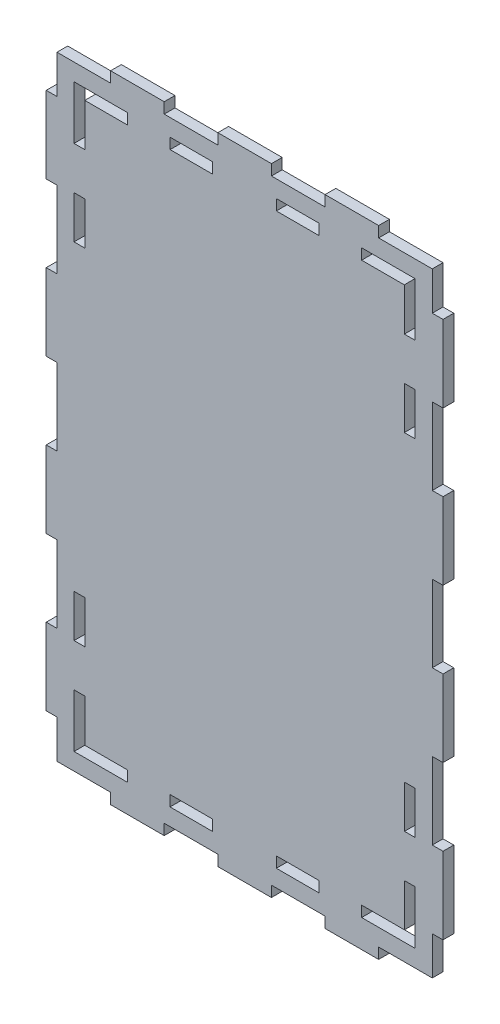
from build123d import *

# Parameters (mm, degrees)
BOSS_EXTRUDE6_DEPTH = 16
SKETCH3_W           = 16.000000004
SKETCH3_H           = 63.5
SKETCH3_W_2         = 63.5
SKETCH3_H_2         = 16.000000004
CUT_EXTRUDE16_DEPTH = 16.002


with BuildPart() as part:
    # Sketch1 → Boss-Extrude6 (new body)
    with BuildSketch(Plane.XY):
        Polygon((-806.858919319, -473.200000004), (-806.858919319, -457.200000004), (-727.03034789, -457.200000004), (-727.03034789, -473.200000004), (-647.201776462, -473.200000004), (-647.201776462, -457.200000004), (-567.373205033, -457.200000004), (-567.373205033, -473.200000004), (-487.544633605, -473.200000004), (-487.544633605, -457.200000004), (-407.716062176, -457.200000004), (-407.716062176, -400.050000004), (-391.716062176, -400.050000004), (-391.716062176, -285.750000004), (-407.716062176, -285.750000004), (-407.716062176, -171.450000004), (-391.716062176, -171.450000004), (-391.716062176, -57.150000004), (-407.716062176, -57.150000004), (-407.716062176, 57.149999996), (-391.716062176, 57.149999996), (-391.716062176, 171.449999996), (-407.716062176, 171.449999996), (-407.716062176, 285.749999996), (-391.716062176, 285.749999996), (-391.716062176, 400.049999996), (-407.716062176, 400.049999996), (-407.716062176, 457.199999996), (-487.544633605, 457.199999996), (-487.544633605, 473.199999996), (-567.373205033, 473.199999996), (-567.373205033, 457.199999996), (-647.201776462, 457.199999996), (-647.201776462, 473.199999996), (-727.03034789, 473.199999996), (-727.03034789, 457.199999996), (-806.858919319, 457.199999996), (-806.858919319, 473.199999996), (-886.687490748, 473.199999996), (-886.687490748, 457.199999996), (-966.516062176, 457.199999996), (-966.516062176, 400.049999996), (-982.516062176, 400.049999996), (-982.516062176, 285.749999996), (-966.516062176, 285.749999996), (-966.516062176, 171.449999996), (-982.516062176, 171.449999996), (-982.516062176, 57.149999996), (-966.516062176, 57.149999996), (-966.516062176, -57.150000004), (-982.516062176, -57.150000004), (-982.516062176, -171.450000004), (-966.516062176, -171.450000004), (-966.516062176, -285.750000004), (-982.516062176, -285.750000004), (-982.516062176, -400.050000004), (-966.516062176, -400.050000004), (-966.516062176, -457.200000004), (-886.687490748, -457.200000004), (-886.687490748, -473.200000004), align=None)
    extrude(amount=BOSS_EXTRUDE6_DEPTH)

    # Sketch3 → Cut-Extrude16 (cut)
    with BuildSketch(Plane.XY):
        Polygon((-925.116062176, 415.799999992), (-861.616062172, 415.799999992), (-861.616062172, 431.799999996), (-941.116062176, 431.799999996), (-941.116062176, 352.299999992), (-925.116062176, 352.299999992), align=None)
        Polygon((-576.406347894, -415.801999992), (-576.406347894, -431.8), (-639.906347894, -431.8), (-639.906347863, -415.8), align=None)
        Polygon((-433.116062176, -288.800000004), (-433.116062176, -225.3), (-449.116062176, -225.300000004), (-449.11606218, -288.800000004), align=None)
        Polygon((-449.11606218, -352.300000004), (-433.116062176, -352.300000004), (-433.116062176, -431.800000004), (-512.906347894, -431.800000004), (-512.906347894, -415.800000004), (-449.11606218, -415.800000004), align=None)
        Polygon((-449.406347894, 288.799999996), (-449.406347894, 225.299999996), (-433.406347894, 225.299999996), (-433.406385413, 288.800047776), align=None)
        Polygon((-449.406347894, 415.799999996), (-449.328484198, 352.300047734), (-433.328484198, 352.299999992), (-433.328484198, 431.799999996), (-512.906347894, 431.799999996), (-512.906347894, 415.799999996), align=None)
        Polygon((-925.116062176, -352.3), (-941.116062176, -352.3), (-941.116062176, -431.800000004), (-861.616062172, -431.800000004), (-861.616062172, -415.8), (-925.116062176, -415.8), align=None)
        Polygon((-941.116062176, -288.8), (-941.116062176, -225.3), (-925.116062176, -225.300000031), (-925.118062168, -288.8), align=None)
        with Locations((-933.116062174, 257.049999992)):
            Rectangle(SKETCH3_W, SKETCH3_H)
        Polygon((-576.406347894, 431.799999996), (-639.906347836, 431.799999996), (-639.906347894, 415.799999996), (-576.406347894, 415.8), align=None)
        Polygon((-798.116062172, -415.801999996), (-734.616062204, -415.800000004), (-734.616062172, -431.800000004), (-798.116062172, -431.800000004), align=None)
        with Locations((-766.366062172, 423.799999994)):
            Rectangle(SKETCH3_W_2, SKETCH3_H_2)
    extrude(amount=CUT_EXTRUDE16_DEPTH, mode=Mode.SUBTRACT)


solid = part.part
